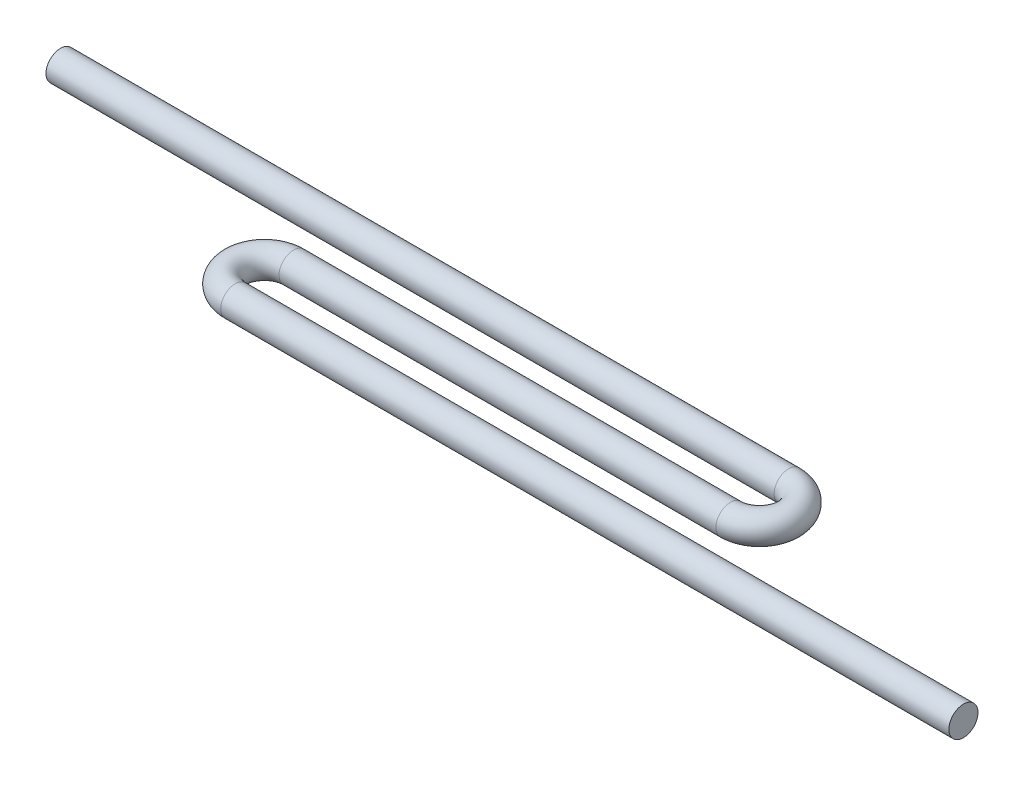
from build123d import *

# Parameters (mm, degrees)
SKETCH2_R = 5
SHELL1_T  = 1.5


with BuildPart() as part:
    # Sweep1: sweep along a path in Sketch1
    with BuildLine(Plane(origin=(0, 0, 0), x_dir=(1, 0, 0), z_dir=(0, 1, 0))) as sweep1_path:
        Line((0, 0), (250, 0))
        ThreePointArc((250, 0), (260, -10), (250, -20))
        Line((250, -20), (100, -20))
        ThreePointArc((100, -20), (90, -30), (100, -40))
        Line((100, -40), (350, -40))
    # Sketch2 → Sweep1 (sweep)
    with BuildSketch(Plane(origin=(0, 0, 0), x_dir=(0, 0, -1), z_dir=(1, 0, 0))):
        Circle(SKETCH2_R)
    sweep(path=sweep1_path.line)

    # Shell1 (no face opened: a closed hollow body)
    add(offset(amount=-SHELL1_T, mode=Mode.PRIVATE), mode=Mode.SUBTRACT)


solid = part.part
